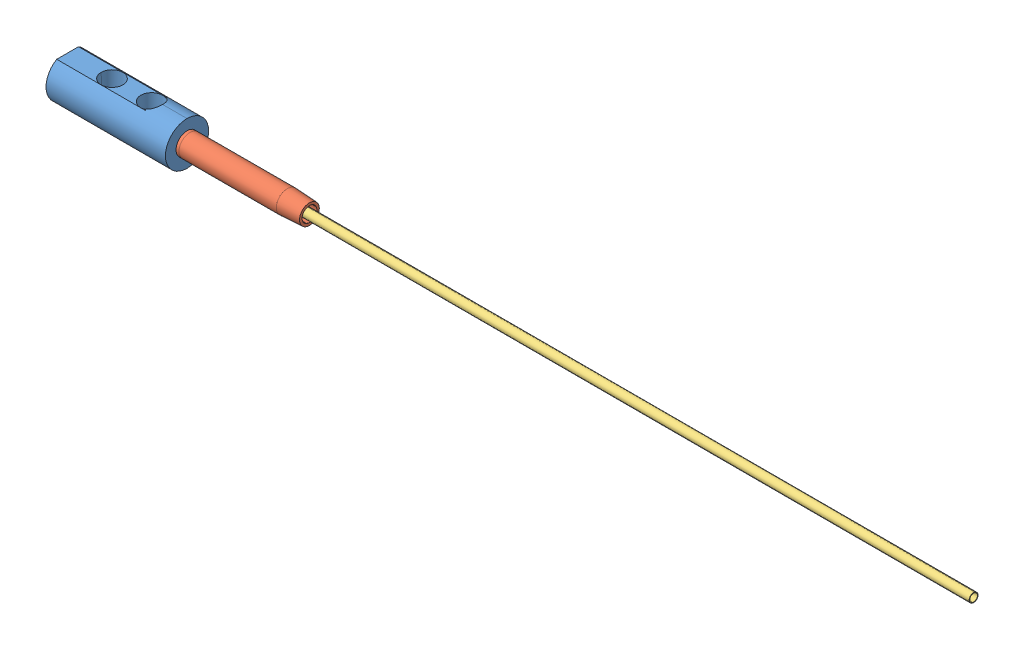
SolidWorks assembly HKC1616.sldasm, configuration Default (file format 11000). Lengths in mm.
Overall size (325.04 15.49 15.49).
3 component instances, 3 part files, 3 mates.
Components (placement in the parent):
- HKCH1616-1: HKCH1616.sldprt [Default] at (0 -7.747 0) x (1 0 0) z (0 1 0) size (42.85 15.49 15.49)
- GPN06L2-1: GPN06L2.SLDPRT [Default] at (35.9664 0 0) x (1 0 0) z (0 0.107711 0.994182) size (50.8 7.94 7.94)
- HFT125L12-1: HFT125L12.SLDPRT [Default] at (20.2438 0 0) x (0 0.646531 0.762888) z (0 0.762888 -0.646531) size (4.83 304.8 4.83)
Mates (geometry in assembly coordinates):
- ProfileCenter1: profile center: circle of HFT125L12-1; plane of HKCH1616-1 through (20.2438 -1.3843 0) normal (1 0 0)
- Coincident1: coincident: plane of HKCH1616-1 through (35.9664 -3.6017 0) normal (1 0 0); circle of GPN06L2-1
- Concentric1: concentric: cylinder of GPN06L2-1 through (36.4425 0 0) axis (-1 0 0) radius 3.9688; cylinder of HFT125L12-1 through (20.2438 0 0) axis (-1 0 0) radius 1.5875
